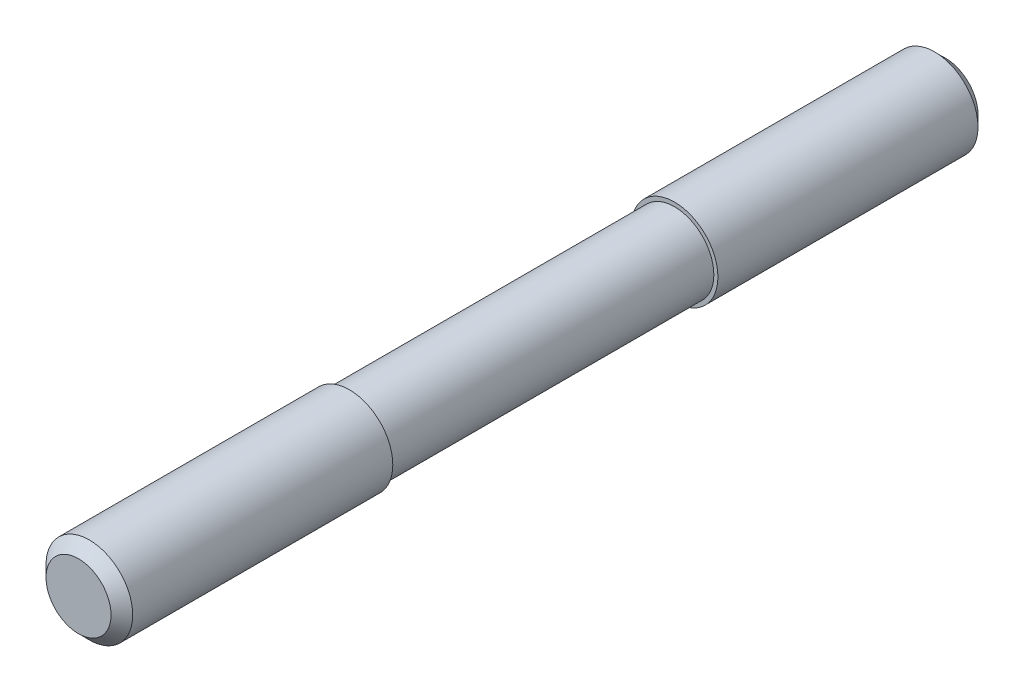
ISO-10303-21;
HEADER;
FILE_DESCRIPTION(('STEP AP214'),'2;1');
FILE_NAME('part.step','',(''),(''),'','','');
FILE_SCHEMA(('AUTOMOTIVE_DESIGN { 1 0 10303 214 1 1 1 1 }'));
ENDSEC;
DATA;
#1=APPLICATION_CONTEXT('core data for automotive mechanical design processes');
#2=APPLICATION_PROTOCOL_DEFINITION('international standard','automotive_design',2000,#1);
#3=PRODUCT_CONTEXT('',#1,'mechanical');
#4=PRODUCT('Part','Part','',(#3));
#5=PRODUCT_RELATED_PRODUCT_CATEGORY('part','',(#4));
#6=PRODUCT_DEFINITION_FORMATION('','',#4);
#7=PRODUCT_DEFINITION_CONTEXT('part definition',#1,'design');
#8=PRODUCT_DEFINITION('design','',#6,#7);
#9=PRODUCT_DEFINITION_SHAPE('','',#8);
#10=(LENGTH_UNIT() NAMED_UNIT(*) SI_UNIT(.MILLI.,.METRE.));
#11=(NAMED_UNIT(*) PLANE_ANGLE_UNIT() SI_UNIT($,.RADIAN.));
#12=(NAMED_UNIT(*) SI_UNIT($,.STERADIAN.) SOLID_ANGLE_UNIT());
#13=UNCERTAINTY_MEASURE_WITH_UNIT(LENGTH_MEASURE(1.E-05),#10,'distance_accuracy_value','');
#14=(GEOMETRIC_REPRESENTATION_CONTEXT(3) GLOBAL_UNCERTAINTY_ASSIGNED_CONTEXT((#13)) GLOBAL_UNIT_ASSIGNED_CONTEXT((#10,
#11,#12)) REPRESENTATION_CONTEXT('',''));
#15=CARTESIAN_POINT('',(0.,0.,0.));
#16=DIRECTION('',(0.,0.,1.));
#17=DIRECTION('',(1.,0.,0.));
#18=AXIS2_PLACEMENT_3D('',#15,#16,#17);
#19=CARTESIAN_POINT('',(0.,0.,0.));
#20=DIRECTION('',(0.,0.,1.));
#21=DIRECTION('',(1.,0.,0.));
#22=AXIS2_PLACEMENT_3D('',#19,#20,#21);
#23=PLANE('',#22);
#24=CARTESIAN_POINT('',(0.,0.,0.));
#25=DIRECTION('',(0.,0.,1.));
#26=DIRECTION('',(1.,0.,0.));
#27=AXIS2_PLACEMENT_3D('',#24,#25,#26);
#28=CIRCLE('',#27,6.);
#29=CARTESIAN_POINT('',(6.,0.,0.));
#30=VERTEX_POINT('',#29);
#31=EDGE_CURVE('E8',#30,#30,#28,.T.);
#32=ORIENTED_EDGE('',*,*,#31,.F.);
#33=EDGE_LOOP('',(#32));
#34=FACE_BOUND('',#33,.T.);
#35=ADVANCED_FACE('F12',(#34),#23,.F.);
#36=CARTESIAN_POINT('',(0.,0.,2.));
#37=DIRECTION('',(0.,0.,1.));
#38=DIRECTION('',(1.,0.,0.));
#39=AXIS2_PLACEMENT_3D('',#36,#37,#38);
#40=CONICAL_SURFACE('',#39,8.,0.785398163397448);
#41=ORIENTED_EDGE('',*,*,#31,.T.);
#42=EDGE_LOOP('',(#41));
#43=FACE_BOUND('',#42,.T.);
#44=CARTESIAN_POINT('',(0.,0.,2.));
#45=DIRECTION('',(0.,0.,1.));
#46=DIRECTION('',(1.,0.,0.));
#47=AXIS2_PLACEMENT_3D('',#44,#45,#46);
#48=CIRCLE('',#47,8.);
#49=CARTESIAN_POINT('',(8.,0.,2.));
#50=VERTEX_POINT('',#49);
#51=EDGE_CURVE('E18',#50,#50,#48,.T.);
#52=ORIENTED_EDGE('',*,*,#51,.F.);
#53=EDGE_LOOP('',(#52));
#54=FACE_BOUND('',#53,.T.);
#55=ADVANCED_FACE('F62',(#43,#54),#40,.T.);
#56=CARTESIAN_POINT('',(0.,0.,70.));
#57=DIRECTION('',(0.,0.,1.));
#58=DIRECTION('',(1.,0.,0.));
#59=AXIS2_PLACEMENT_3D('',#56,#57,#58);
#60=CYLINDRICAL_SURFACE('',#59,8.);
#61=CARTESIAN_POINT('',(0.,0.,50.));
#62=DIRECTION('',(0.,0.,1.));
#63=DIRECTION('',(1.,0.,0.));
#64=AXIS2_PLACEMENT_3D('',#61,#62,#63);
#65=CIRCLE('',#64,8.);
#66=CARTESIAN_POINT('',(8.,0.,50.));
#67=VERTEX_POINT('',#66);
#68=EDGE_CURVE('E22',#67,#67,#65,.T.);
#69=ORIENTED_EDGE('',*,*,#68,.F.);
#70=EDGE_LOOP('',(#69));
#71=FACE_BOUND('',#70,.T.);
#72=ORIENTED_EDGE('',*,*,#51,.T.);
#73=EDGE_LOOP('',(#72));
#74=FACE_BOUND('',#73,.T.);
#75=ADVANCED_FACE('F68',(#71,#74),#60,.T.);
#76=CARTESIAN_POINT('',(8.,0.,50.));
#77=DIRECTION('',(0.,0.,-1.));
#78=DIRECTION('',(-1.,0.,0.));
#79=AXIS2_PLACEMENT_3D('',#76,#77,#78);
#80=PLANE('',#79);
#81=CARTESIAN_POINT('',(0.,0.,50.));
#82=DIRECTION('',(0.,0.,1.));
#83=DIRECTION('',(1.,0.,0.));
#84=AXIS2_PLACEMENT_3D('',#81,#82,#83);
#85=CIRCLE('',#84,7.25);
#86=CARTESIAN_POINT('',(7.25,0.,50.));
#87=VERTEX_POINT('',#86);
#88=EDGE_CURVE('E26',#87,#87,#85,.T.);
#89=ORIENTED_EDGE('',*,*,#88,.F.);
#90=EDGE_LOOP('',(#89));
#91=FACE_BOUND('',#90,.T.);
#92=ORIENTED_EDGE('',*,*,#68,.T.);
#93=EDGE_LOOP('',(#92));
#94=FACE_BOUND('',#93,.T.);
#95=ADVANCED_FACE('F73',(#91,#94),#80,.F.);
#96=CARTESIAN_POINT('',(0.,0.,70.));
#97=DIRECTION('',(0.,0.,1.));
#98=DIRECTION('',(1.,0.,0.));
#99=AXIS2_PLACEMENT_3D('',#96,#97,#98);
#100=CYLINDRICAL_SURFACE('',#99,7.25);
#101=CARTESIAN_POINT('',(0.,0.,110.));
#102=DIRECTION('',(0.,0.,1.));
#103=DIRECTION('',(1.,0.,0.));
#104=AXIS2_PLACEMENT_3D('',#101,#102,#103);
#105=CIRCLE('',#104,7.25);
#106=CARTESIAN_POINT('',(7.25,0.,110.));
#107=VERTEX_POINT('',#106);
#108=EDGE_CURVE('E31',#107,#107,#105,.T.);
#109=ORIENTED_EDGE('',*,*,#108,.F.);
#110=EDGE_LOOP('',(#109));
#111=FACE_BOUND('',#110,.T.);
#112=ORIENTED_EDGE('',*,*,#88,.T.);
#113=EDGE_LOOP('',(#112));
#114=FACE_BOUND('',#113,.T.);
#115=ADVANCED_FACE('F80',(#111,#114),#100,.T.);
#116=CARTESIAN_POINT('',(7.25,0.,110.));
#117=DIRECTION('',(0.,0.,1.));
#118=DIRECTION('',(1.,0.,0.));
#119=AXIS2_PLACEMENT_3D('',#116,#117,#118);
#120=PLANE('',#119);
#121=CARTESIAN_POINT('',(0.,0.,110.));
#122=DIRECTION('',(0.,0.,1.));
#123=DIRECTION('',(1.,0.,0.));
#124=AXIS2_PLACEMENT_3D('',#121,#122,#123);
#125=CIRCLE('',#124,8.);
#126=CARTESIAN_POINT('',(8.,0.,110.));
#127=VERTEX_POINT('',#126);
#128=EDGE_CURVE('E34',#127,#127,#125,.T.);
#129=ORIENTED_EDGE('',*,*,#128,.F.);
#130=EDGE_LOOP('',(#129));
#131=FACE_BOUND('',#130,.T.);
#132=ORIENTED_EDGE('',*,*,#108,.T.);
#133=EDGE_LOOP('',(#132));
#134=FACE_BOUND('',#133,.T.);
#135=ADVANCED_FACE('F58',(#131,#134),#120,.F.);
#136=CARTESIAN_POINT('',(0.,0.,70.));
#137=DIRECTION('',(0.,0.,1.));
#138=DIRECTION('',(1.,0.,0.));
#139=AXIS2_PLACEMENT_3D('',#136,#137,#138);
#140=CYLINDRICAL_SURFACE('',#139,8.);
#141=CARTESIAN_POINT('',(0.,0.,158.));
#142=DIRECTION('',(0.,0.,1.));
#143=DIRECTION('',(1.,0.,0.));
#144=AXIS2_PLACEMENT_3D('',#141,#142,#143);
#145=CIRCLE('',#144,8.);
#146=CARTESIAN_POINT('',(8.,0.,158.));
#147=VERTEX_POINT('',#146);
#148=EDGE_CURVE('E37',#147,#147,#145,.T.);
#149=ORIENTED_EDGE('',*,*,#148,.F.);
#150=EDGE_LOOP('',(#149));
#151=FACE_BOUND('',#150,.T.);
#152=ORIENTED_EDGE('',*,*,#128,.T.);
#153=EDGE_LOOP('',(#152));
#154=FACE_BOUND('',#153,.T.);
#155=ADVANCED_FACE('F48',(#151,#154),#140,.T.);
#156=CARTESIAN_POINT('',(0.,0.,160.));
#157=DIRECTION('',(0.,0.,-1.));
#158=DIRECTION('',(-1.,0.,0.));
#159=AXIS2_PLACEMENT_3D('',#156,#157,#158);
#160=CONICAL_SURFACE('',#159,6.,0.785398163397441);
#161=ORIENTED_EDGE('',*,*,#148,.T.);
#162=EDGE_LOOP('',(#161));
#163=FACE_BOUND('',#162,.T.);
#164=CARTESIAN_POINT('',(0.,0.,160.));
#165=DIRECTION('',(0.,0.,1.));
#166=DIRECTION('',(1.,0.,0.));
#167=AXIS2_PLACEMENT_3D('',#164,#165,#166);
#168=CIRCLE('',#167,6.);
#169=CARTESIAN_POINT('',(6.,0.,160.));
#170=VERTEX_POINT('',#169);
#171=EDGE_CURVE('E40',#170,#170,#168,.T.);
#172=ORIENTED_EDGE('',*,*,#171,.F.);
#173=EDGE_LOOP('',(#172));
#174=FACE_BOUND('',#173,.T.);
#175=ADVANCED_FACE('F46',(#163,#174),#160,.T.);
#176=CARTESIAN_POINT('',(6.,0.,160.));
#177=DIRECTION('',(0.,0.,-1.));
#178=DIRECTION('',(-1.,0.,0.));
#179=AXIS2_PLACEMENT_3D('',#176,#177,#178);
#180=PLANE('',#179);
#181=ORIENTED_EDGE('',*,*,#171,.T.);
#182=EDGE_LOOP('',(#181));
#183=FACE_BOUND('',#182,.T.);
#184=ADVANCED_FACE('F44',(#183),#180,.F.);
#185=CLOSED_SHELL('',(#35,#55,#75,#95,#115,#135,#155,#175,#184));
#186=MANIFOLD_SOLID_BREP('B1',#185);
#187=ADVANCED_BREP_SHAPE_REPRESENTATION('',(#18,#186),#14);
#188=SHAPE_DEFINITION_REPRESENTATION(#9,#187);
ENDSEC;
END-ISO-10303-21;
